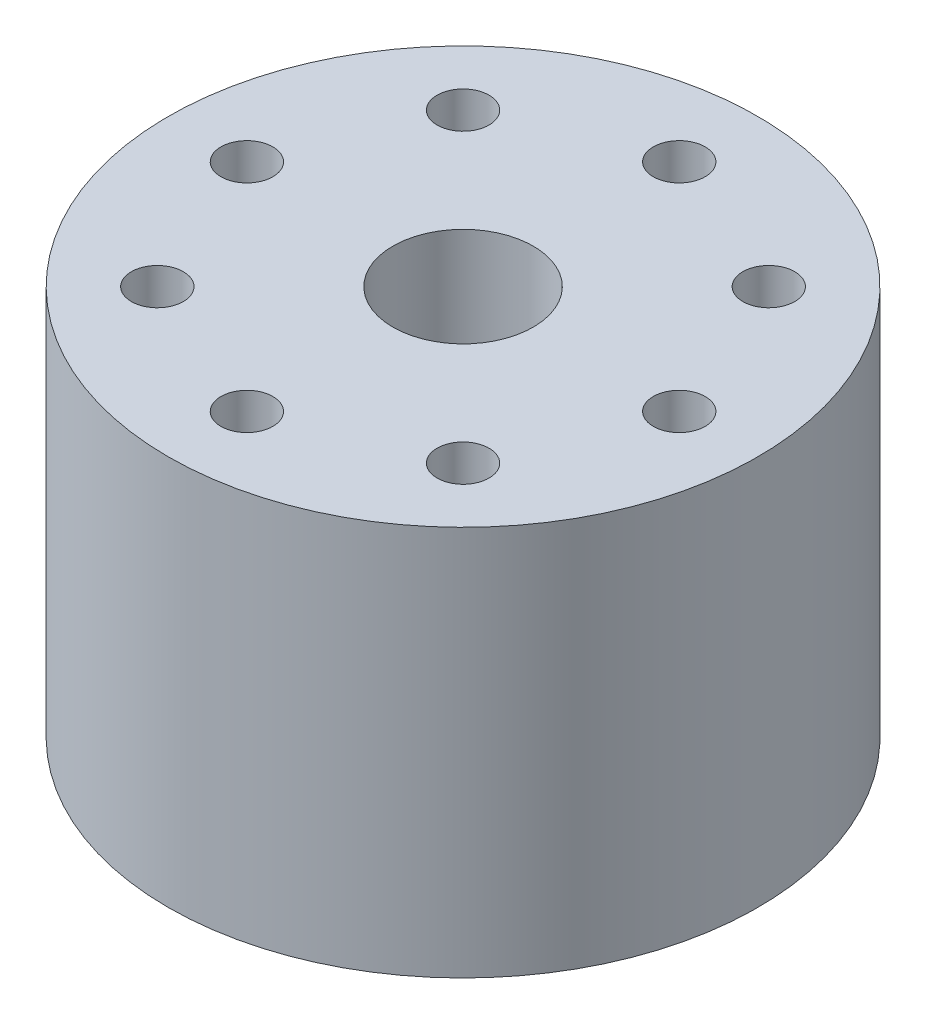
from build123d import *

# Parameters (mm, degrees)
SKETCH1_R                    = 37.5
OUTER_CYLINDER_DEPTH         = 49.65
SKETCH2_R                    = 8.93
NPT_HOLE_DEPTH               = 23
SKETCH3_R                    = 5
OUTER_LEAFLET_DIAMETER_DEPTH = 5
SKETCH4_R                    = 9
DEPTH_DEPTH                  = 3.15
SKETCH8_W                    = 5
SKETCH8_H                    = 16.4
SKETCH9_R                    = 3.3
BOLT_HOLES_DEPTH             = 73.647247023
CHAMFER1_SIZE                = 2
CHAMFER1_SIZE2               = 5.494954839


with BuildPart() as part:
    # Sketch1 → Outer Cylinder (new body)
    with BuildSketch(Plane(origin=(0, 0, 0), x_dir=(1, 0, 0), z_dir=(0, 1, 0))):
        with Locations(Location((0, 0, 0), (0, 0, 270))):
            Circle(SKETCH1_R)
    extrude(amount=OUTER_CYLINDER_DEPTH)

    # Sketch2 → NPT Hole (cut)
    with BuildSketch(Plane(origin=(0, 49.65, 0), x_dir=(1, 0, 0), z_dir=(0, 1, 0))):
        with Locations(Location((0, 0, 0), (0, 0, 270))):
            Circle(SKETCH2_R)
    extrude(amount=-NPT_HOLE_DEPTH, mode=Mode.SUBTRACT)

    # Sketch3 → Outer Leaflet Diameter (cut)
    with BuildSketch(Plane.XZ):
        with Locations(Location((0, 0, 0), (0, 0, 270))):
            Circle(SKETCH3_R)
    extrude(amount=-OUTER_LEAFLET_DIAMETER_DEPTH, mode=Mode.SUBTRACT)

    # Sketch4 → Depth (cut)
    with BuildSketch(Plane.XZ):
        with Locations(Location((0, 0, 0), (0, 0, 270))):
            Circle(SKETCH4_R)
    extrude(amount=-DEPTH_DEPTH, mode=Mode.SUBTRACT)

    # Sketch6 → Aortic Root (revolve, cut)
    with BuildSketch(Plane.XY):
        with BuildLine():
            Line((0, 3.15), (-5, 3.15))
            add(Edge.make_bspline(
                [(-5, 10.25), (-8, 6.7), (-5, 3.15)],
                knots=[0, 0, 0, 1, 1, 1], degree=2))
            Line((-5, 10.25), (0, 10.25))
            Line((0, 10.25), (0, 3.15))
        make_face()
    revolve(axis=Axis((0, 3.15, 0), (0, 1, 0)), mode=Mode.SUBTRACT)

    # Sketch8 → Ascending Aorta (revolve, cut)
    with BuildSketch(Plane.XY):
        with Locations((-2.5, 18.45)):
            Rectangle(SKETCH8_W, SKETCH8_H)
    revolve(axis=Axis((0, 26.65, 0), (0, -1, 0)), mode=Mode.SUBTRACT)

    # Sketch9 → Bolt Holes (cut, through all)
    with BuildSketch(Plane(origin=(0, 49.65, 0), x_dir=(1, 0, 0), z_dir=(0, 1, 0))):
        with Locations(Location((0, -27.5, 0), (0, 0, 270))):
            Circle(SKETCH9_R)
        with Locations(Location((-19.445436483, -19.445436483, 0), (0, 0, 270))):
            Circle(SKETCH9_R)
        with Locations(Location((-27.5, 0, 0), (0, 0, 270))):
            Circle(SKETCH9_R)
        with Locations(Location((-19.445436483, 19.445436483, 0), (0, 0, 270))):
            Circle(SKETCH9_R)
        with Locations(Location((0, 27.5, 0), (0, 0, 270))):
            Circle(SKETCH9_R)
        with Locations(Location((19.445436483, 19.445436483, 0), (0, 0, 270))):
            Circle(SKETCH9_R)
        with Locations(Location((27.5, 0, 0), (0, 0, 270))):
            Circle(SKETCH9_R)
        with Locations(Location((19.445436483, -19.445436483, 0), (0, 0, 270))):
            Circle(SKETCH9_R)
    extrude(amount=-BOLT_HOLES_DEPTH, mode=Mode.SUBTRACT)

    # Chamfer1
    chamfer1_edges = [part.edges().sort_by_distance(p)[0] for p in [
        (5, 26.65, 0),
    ]]
    chamfer1_side = [part.faces().sort_by_distance(p)[0] for p in [
        (0, 26.65, -8.677421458),
    ]]
    chamfer(chamfer1_edges, length=CHAMFER1_SIZE, length2=CHAMFER1_SIZE2, reference=chamfer1_side[0])


solid = part.part
